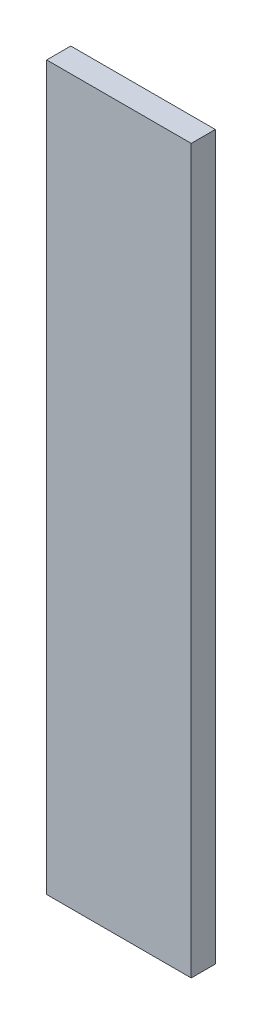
from build123d import *

# Parameters (mm, degrees)
SKIZZE1_W                       = 60
SKIZZE1_H                       = 300
AUFSATZ_LINEAR_AUSTRAGEN1_DEPTH = 10


with BuildPart() as part:
    # Skizze1 → Aufsatz-Linear austragen1 (new body)
    with BuildSketch(Plane.XY):
        with Locations((30, 150)):
            Rectangle(SKIZZE1_W, SKIZZE1_H)
    extrude(amount=AUFSATZ_LINEAR_AUSTRAGEN1_DEPTH)


solid = part.part
